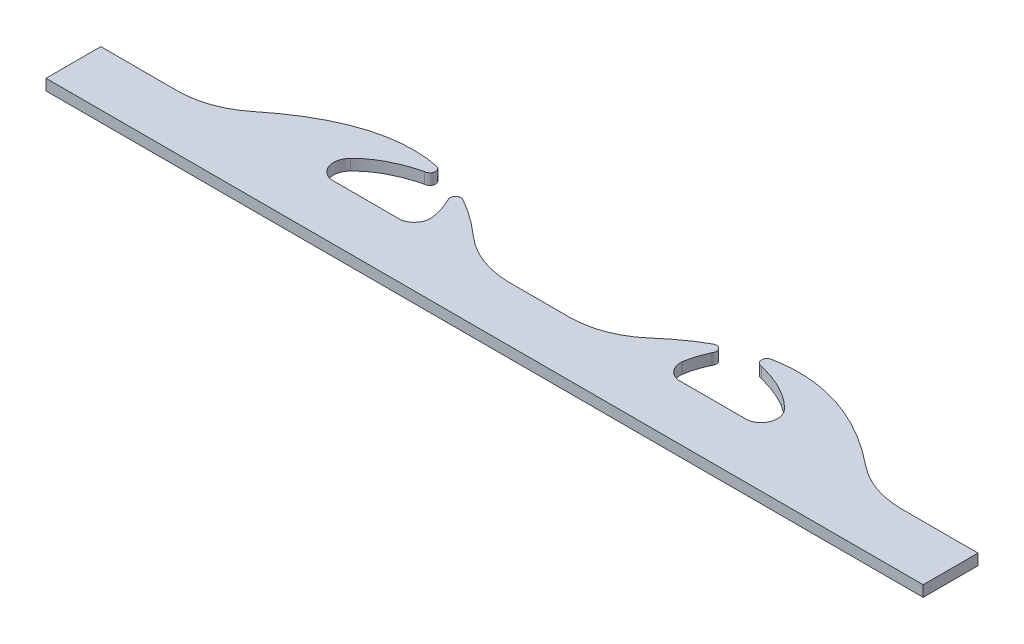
from build123d import *

# Parameters (mm, degrees)
EXTRUDE_1_DEPTH = 1


with BuildPart() as part:
    # Sketch 1 → Extrude 1 (new body)
    with BuildSketch(Plane(origin=(0, 0, 0), x_dir=(1, 0, 0), z_dir=(0, 1, 0))):
        with BuildLine():
            Line((40, 0), (40, 5))
            Line((40, 5), (33.011381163, 5))
            ThreePointArc((33.011381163, 5), (30.341408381, 5.458697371), (27.977612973, 6.782188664))
            add(Edge.make_bspline(
                [(27.977612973, 6.782188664), (23.85392157, 10.12061524), (19.583521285, 11.624399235), (15.463165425, 10.917348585), (15.195701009, 10.861982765)],
                knots=[0.079226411, 0.079226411, 0.079226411, 0.079226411, 0.566366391, 0.600269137, 0.600269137, 0.600269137, 0.600269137], degree=3))
            ThreePointArc((15.195701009, 10.861982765), (14.879634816, 10.304557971), (15.371581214, 9.893937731))
            add(Edge.make_bspline(
                [(15.371581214, 9.893937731), (18.355981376, 9.144698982), (19.533449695, 7.807167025), (19.797042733, 7.545679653)],
                knots=[0, 0, 0, 0, 1, 1, 1, 1], degree=3))
            ThreePointArc((19.797042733, 7.545679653), (20.178639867, 6.033945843), (19.011630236, 5))
            Line((19.011630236, 5), (12.625423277, 5))
            ThreePointArc((12.625423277, 5), (11.698521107, 5.567203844), (11.397858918, 6.611459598))
            add(Edge.make_bspline(
                [(12.035567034, 8.682516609), (11.509930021, 7.511593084), (11.397858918, 6.611459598)],
                knots=[0, 0, 0, 1, 1, 1], degree=2))
            ThreePointArc((12.035567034, 8.682516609), (12.04755142, 9.288801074), (11.466038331, 9.460751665))
            add(Edge.make_bspline(
                [(11.466038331, 9.460751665), (10.887275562, 9.143445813), (9.735973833, 8.417129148), (8.597119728, 7.507402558), (8.03080458, 7.006686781)],
                knots=[0.759634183, 0.759634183, 0.759634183, 0.759634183, 0.834671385, 0.909708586, 0.909708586, 0.909708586, 0.909708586], degree=3))
            ThreePointArc((8.03080458, 7.006686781), (5.564880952, 5.518472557), (2.731729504, 5))
            Line((2.731729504, 5), (-2.731729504, 5))
            ThreePointArc((-2.731729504, 5), (-5.564880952, 5.518472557), (-8.03080458, 7.006686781))
            add(Edge.make_bspline(
                [(-11.466038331, 9.460751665), (-10.887275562, 9.143445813), (-9.735973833, 8.417129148), (-8.597119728, 7.507402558), (-8.03080458, 7.006686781)],
                knots=[0.759634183, 0.759634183, 0.759634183, 0.759634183, 0.834671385, 0.909708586, 0.909708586, 0.909708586, 0.909708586], degree=3))
            ThreePointArc((-11.466038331, 9.460751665), (-12.04755142, 9.288801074), (-12.035567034, 8.682516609))
            add(Edge.make_bspline(
                [(-12.035567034, 8.682516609), (-11.509930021, 7.511593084), (-11.397858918, 6.611459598)],
                knots=[0, 0, 0, 1, 1, 1], degree=2))
            ThreePointArc((-11.397858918, 6.611459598), (-11.698521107, 5.567203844), (-12.625423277, 5))
            Line((-12.625423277, 5), (-19.011630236, 5))
            ThreePointArc((-19.011630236, 5), (-20.178639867, 6.033945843), (-19.797042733, 7.545679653))
            add(Edge.make_bspline(
                [(-15.371581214, 9.893937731), (-18.355981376, 9.144698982), (-19.533449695, 7.807167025), (-19.797042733, 7.545679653)],
                knots=[0, 0, 0, 0, 1, 1, 1, 1], degree=3))
            ThreePointArc((-15.371581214, 9.893937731), (-14.879634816, 10.304557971), (-15.195701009, 10.861982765))
            add(Edge.make_bspline(
                [(-27.977612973, 6.782188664), (-23.85392157, 10.12061524), (-19.583521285, 11.624399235), (-15.463165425, 10.917348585), (-15.195701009, 10.861982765)],
                knots=[0.079226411, 0.079226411, 0.079226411, 0.079226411, 0.566366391, 0.600269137, 0.600269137, 0.600269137, 0.600269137], degree=3))
            ThreePointArc((-27.977612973, 6.782188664), (-30.341408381, 5.458697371), (-33.011381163, 5))
            Line((-33.011381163, 5), (-40, 5))
            Line((-40, 5), (-40, 0))
            Line((-40, 0), (40, 0))
        make_face()
    extrude(amount=EXTRUDE_1_DEPTH)


solid = part.part
